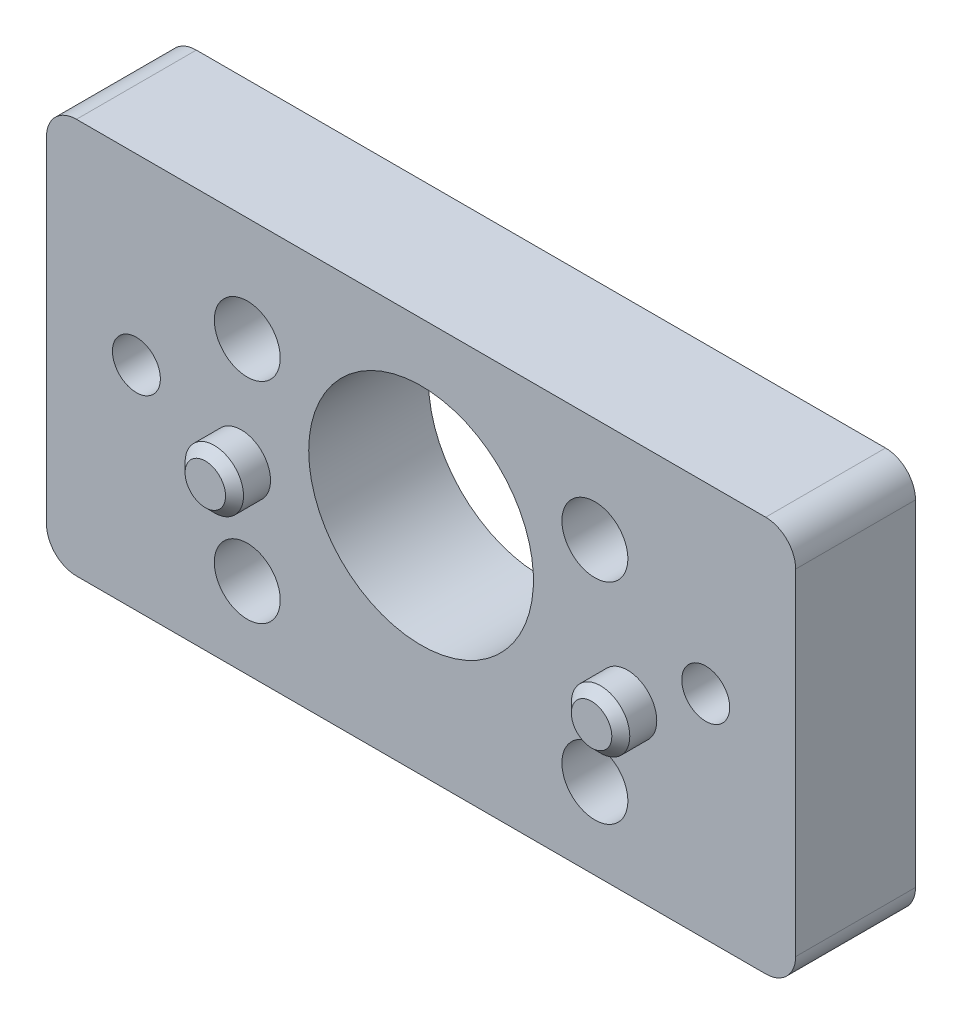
ISO-10303-21;
HEADER;
FILE_DESCRIPTION(('STEP AP214'),'2;1');
FILE_NAME('part.step','',(''),(''),'','','');
FILE_SCHEMA(('AUTOMOTIVE_DESIGN { 1 0 10303 214 1 1 1 1 }'));
ENDSEC;
DATA;
#1=APPLICATION_CONTEXT('core data for automotive mechanical design processes');
#2=APPLICATION_PROTOCOL_DEFINITION('international standard','automotive_design',2000,#1);
#3=PRODUCT_CONTEXT('',#1,'mechanical');
#4=PRODUCT('Part','Part','',(#3));
#5=PRODUCT_RELATED_PRODUCT_CATEGORY('part','',(#4));
#6=PRODUCT_DEFINITION_FORMATION('','',#4);
#7=PRODUCT_DEFINITION_CONTEXT('part definition',#1,'design');
#8=PRODUCT_DEFINITION('design','',#6,#7);
#9=PRODUCT_DEFINITION_SHAPE('','',#8);
#10=(LENGTH_UNIT() NAMED_UNIT(*) SI_UNIT(.MILLI.,.METRE.));
#11=(NAMED_UNIT(*) PLANE_ANGLE_UNIT() SI_UNIT($,.RADIAN.));
#12=(NAMED_UNIT(*) SI_UNIT($,.STERADIAN.) SOLID_ANGLE_UNIT());
#13=UNCERTAINTY_MEASURE_WITH_UNIT(LENGTH_MEASURE(1.E-05),#10,'distance_accuracy_value','');
#14=(GEOMETRIC_REPRESENTATION_CONTEXT(3) GLOBAL_UNCERTAINTY_ASSIGNED_CONTEXT((#13)) GLOBAL_UNIT_ASSIGNED_CONTEXT((#10,
#11,#12)) REPRESENTATION_CONTEXT('',''));
#15=CARTESIAN_POINT('',(0.,0.,0.));
#16=DIRECTION('',(0.,0.,1.));
#17=DIRECTION('',(1.,0.,0.));
#18=AXIS2_PLACEMENT_3D('',#15,#16,#17);
#19=CARTESIAN_POINT('',(0.,0.,4.));
#20=DIRECTION('',(0.,0.,1.));
#21=DIRECTION('',(1.,0.,0.));
#22=AXIS2_PLACEMENT_3D('',#19,#20,#21);
#23=PLANE('',#22);
#24=CARTESIAN_POINT('',(9.5,1.,4.));
#25=DIRECTION('',(0.,0.,1.));
#26=DIRECTION('',(1.,0.,0.));
#27=AXIS2_PLACEMENT_3D('',#24,#25,#26);
#28=CIRCLE('',#27,0.799999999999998);
#29=CARTESIAN_POINT('',(10.3,1.,4.));
#30=VERTEX_POINT('',#29);
#31=EDGE_CURVE('E373',#30,#30,#28,.T.);
#32=ORIENTED_EDGE('',*,*,#31,.F.);
#33=EDGE_LOOP('',(#32));
#34=FACE_BOUND('',#33,.T.);
#35=CARTESIAN_POINT('',(-9.5,1.,4.));
#36=DIRECTION('',(0.,0.,1.));
#37=DIRECTION('',(1.,0.,0.));
#38=AXIS2_PLACEMENT_3D('',#35,#36,#37);
#39=CIRCLE('',#38,0.799999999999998);
#40=CARTESIAN_POINT('',(-8.7,1.,4.));
#41=VERTEX_POINT('',#40);
#42=EDGE_CURVE('E182',#41,#41,#39,.T.);
#43=ORIENTED_EDGE('',*,*,#42,.F.);
#44=EDGE_LOOP('',(#43));
#45=FACE_BOUND('',#44,.T.);
#46=CARTESIAN_POINT('',(6.89030643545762,-0.600000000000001,4.));
#47=DIRECTION('',(0.,0.,1.));
#48=DIRECTION('',(1.,0.,0.));
#49=AXIS2_PLACEMENT_3D('',#46,#47,#48);
#50=CIRCLE('',#49,0.975);
#51=CARTESIAN_POINT('',(7.86530643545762,-0.600000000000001,4.));
#52=VERTEX_POINT('',#51);
#53=EDGE_CURVE('E196',#52,#52,#50,.T.);
#54=ORIENTED_EDGE('',*,*,#53,.F.);
#55=EDGE_LOOP('',(#54));
#56=FACE_BOUND('',#55,.T.);
#57=CARTESIAN_POINT('',(-6.,-0.0999999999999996,4.));
#58=DIRECTION('',(0.,0.,1.));
#59=DIRECTION('',(1.,0.,0.));
#60=AXIS2_PLACEMENT_3D('',#57,#58,#59);
#61=CIRCLE('',#60,0.975);
#62=CARTESIAN_POINT('',(-5.025,-0.0999999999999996,4.));
#63=VERTEX_POINT('',#62);
#64=EDGE_CURVE('E199',#63,#63,#61,.T.);
#65=ORIENTED_EDGE('',*,*,#64,.F.);
#66=EDGE_LOOP('',(#65));
#67=FACE_BOUND('',#66,.T.);
#68=CARTESIAN_POINT('',(0.,1.4,4.));
#69=DIRECTION('',(0.,0.,-1.));
#70=DIRECTION('',(-1.,0.,0.));
#71=AXIS2_PLACEMENT_3D('',#68,#69,#70);
#72=CIRCLE('',#71,3.75);
#73=CARTESIAN_POINT('',(-3.75,1.4,4.));
#74=VERTEX_POINT('',#73);
#75=EDGE_CURVE('E203',#74,#74,#72,.T.);
#76=ORIENTED_EDGE('',*,*,#75,.T.);
#77=EDGE_LOOP('',(#76));
#78=FACE_BOUND('',#77,.T.);
#79=CARTESIAN_POINT('',(5.8,-3.4,4.));
#80=DIRECTION('',(0.,0.,-1.));
#81=DIRECTION('',(-1.,0.,0.));
#82=AXIS2_PLACEMENT_3D('',#79,#80,#81);
#83=CIRCLE('',#82,1.10000000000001);
#84=CARTESIAN_POINT('',(4.69999999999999,-3.4,4.));
#85=VERTEX_POINT('',#84);
#86=EDGE_CURVE('E241',#85,#85,#83,.T.);
#87=ORIENTED_EDGE('',*,*,#86,.T.);
#88=EDGE_LOOP('',(#87));
#89=FACE_BOUND('',#88,.T.);
#90=CARTESIAN_POINT('',(-5.8,-3.39999999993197,4.));
#91=DIRECTION('',(0.,0.,-1.));
#92=DIRECTION('',(-1.,0.,0.));
#93=AXIS2_PLACEMENT_3D('',#90,#91,#92);
#94=CIRCLE('',#93,1.10000000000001);
#95=CARTESIAN_POINT('',(-6.90000000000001,-3.39999999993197,4.));
#96=VERTEX_POINT('',#95);
#97=EDGE_CURVE('E253',#96,#96,#94,.T.);
#98=ORIENTED_EDGE('',*,*,#97,.T.);
#99=EDGE_LOOP('',(#98));
#100=FACE_BOUND('',#99,.T.);
#101=DIRECTION('',(1.,0.,0.));
#102=VECTOR('',#101,1.);
#103=CARTESIAN_POINT('',(-12.5,7.1,4.));
#104=LINE('',#103,#102);
#105=CARTESIAN_POINT('',(-11.5,7.1,4.));
#106=VERTEX_POINT('',#105);
#107=CARTESIAN_POINT('',(11.5,7.1,4.));
#108=VERTEX_POINT('',#107);
#109=EDGE_CURVE('E369',#106,#108,#104,.T.);
#110=ORIENTED_EDGE('',*,*,#109,.F.);
#111=CARTESIAN_POINT('',(-11.5,6.1,4.));
#112=DIRECTION('',(0.,0.,1.));
#113=DIRECTION('',(1.,0.,0.));
#114=AXIS2_PLACEMENT_3D('',#111,#112,#113);
#115=CIRCLE('',#114,1.);
#116=CARTESIAN_POINT('',(-12.5,6.1,4.));
#117=VERTEX_POINT('',#116);
#118=EDGE_CURVE('E325',#106,#117,#115,.T.);
#119=ORIENTED_EDGE('',*,*,#118,.T.);
#120=DIRECTION('',(0.,-1.,0.));
#121=VECTOR('',#120,1.);
#122=CARTESIAN_POINT('',(-12.5,6.1,4.));
#123=LINE('',#122,#121);
#124=CARTESIAN_POINT('',(-12.5,-5.1,4.));
#125=VERTEX_POINT('',#124);
#126=EDGE_CURVE('E260',#117,#125,#123,.T.);
#127=ORIENTED_EDGE('',*,*,#126,.T.);
#128=CARTESIAN_POINT('',(-11.5,-5.1,4.));
#129=DIRECTION('',(0.,0.,1.));
#130=DIRECTION('',(1.,0.,0.));
#131=AXIS2_PLACEMENT_3D('',#128,#129,#130);
#132=CIRCLE('',#131,1.);
#133=CARTESIAN_POINT('',(-11.5,-6.1,4.));
#134=VERTEX_POINT('',#133);
#135=EDGE_CURVE('E321',#125,#134,#132,.T.);
#136=ORIENTED_EDGE('',*,*,#135,.T.);
#137=DIRECTION('',(1.,0.,0.));
#138=VECTOR('',#137,1.);
#139=CARTESIAN_POINT('',(-12.5,-6.1,4.));
#140=LINE('',#139,#138);
#141=CARTESIAN_POINT('',(11.5,-6.1,4.));
#142=VERTEX_POINT('',#141);
#143=EDGE_CURVE('E264',#134,#142,#140,.T.);
#144=ORIENTED_EDGE('',*,*,#143,.T.);
#145=CARTESIAN_POINT('',(11.5,-5.1,4.));
#146=DIRECTION('',(0.,0.,1.));
#147=DIRECTION('',(1.,0.,0.));
#148=AXIS2_PLACEMENT_3D('',#145,#146,#147);
#149=CIRCLE('',#148,1.);
#150=CARTESIAN_POINT('',(12.5,-5.1,4.));
#151=VERTEX_POINT('',#150);
#152=EDGE_CURVE('E319',#142,#151,#149,.T.);
#153=ORIENTED_EDGE('',*,*,#152,.T.);
#154=DIRECTION('',(0.,1.,0.));
#155=VECTOR('',#154,1.);
#156=CARTESIAN_POINT('',(12.5,6.1,4.));
#157=LINE('',#156,#155);
#158=CARTESIAN_POINT('',(12.5,6.1,4.));
#159=VERTEX_POINT('',#158);
#160=EDGE_CURVE('E257',#151,#159,#157,.T.);
#161=ORIENTED_EDGE('',*,*,#160,.T.);
#162=CARTESIAN_POINT('',(11.5,6.1,4.));
#163=DIRECTION('',(0.,0.,1.));
#164=DIRECTION('',(1.,0.,0.));
#165=AXIS2_PLACEMENT_3D('',#162,#163,#164);
#166=CIRCLE('',#165,1.);
#167=EDGE_CURVE('E323',#159,#108,#166,.T.);
#168=ORIENTED_EDGE('',*,*,#167,.T.);
#169=EDGE_LOOP('',(#110,#119,#127,#136,#144,#153,#161,#168));
#170=FACE_BOUND('',#169,.T.);
#171=CARTESIAN_POINT('',(-5.8,3.59999999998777,4.));
#172=DIRECTION('',(0.,0.,-1.));
#173=DIRECTION('',(-1.,0.,0.));
#174=AXIS2_PLACEMENT_3D('',#171,#172,#173);
#175=CIRCLE('',#174,1.10000000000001);
#176=CARTESIAN_POINT('',(-6.90000000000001,3.59999999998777,4.));
#177=VERTEX_POINT('',#176);
#178=EDGE_CURVE('E229',#177,#177,#175,.T.);
#179=ORIENTED_EDGE('',*,*,#178,.T.);
#180=EDGE_LOOP('',(#179));
#181=FACE_BOUND('',#180,.T.);
#182=CARTESIAN_POINT('',(5.8,3.59999999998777,4.));
#183=DIRECTION('',(0.,0.,-1.));
#184=DIRECTION('',(-1.,0.,0.));
#185=AXIS2_PLACEMENT_3D('',#182,#183,#184);
#186=CIRCLE('',#185,1.10000000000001);
#187=CARTESIAN_POINT('',(4.69999999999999,3.59999999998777,4.));
#188=VERTEX_POINT('',#187);
#189=EDGE_CURVE('E217',#188,#188,#186,.T.);
#190=ORIENTED_EDGE('',*,*,#189,.T.);
#191=EDGE_LOOP('',(#190));
#192=FACE_BOUND('',#191,.T.);
#193=ADVANCED_FACE('F49',(#34,#45,#56,#67,#78,#89,#100,#170,#181,#192),#23,.T.);
#194=CARTESIAN_POINT('',(12.5,6.1,4.));
#195=DIRECTION('',(-1.,0.,0.));
#196=DIRECTION('',(0.,0.,1.));
#197=AXIS2_PLACEMENT_3D('',#194,#195,#196);
#198=PLANE('',#197);
#199=DIRECTION('',(0.,1.,0.));
#200=VECTOR('',#199,1.);
#201=CARTESIAN_POINT('',(12.5,6.1,0.));
#202=LINE('',#201,#200);
#203=CARTESIAN_POINT('',(12.5,-5.1,0.));
#204=VERTEX_POINT('',#203);
#205=CARTESIAN_POINT('',(12.5,6.1,0.));
#206=VERTEX_POINT('',#205);
#207=EDGE_CURVE('E256',#204,#206,#202,.T.);
#208=ORIENTED_EDGE('',*,*,#207,.T.);
#209=DIRECTION('',(0.,0.,-1.));
#210=VECTOR('',#209,1.);
#211=CARTESIAN_POINT('',(12.5,6.1,4.));
#212=LINE('',#211,#210);
#213=EDGE_CURVE('E340',#206,#159,#212,.F.);
#214=ORIENTED_EDGE('',*,*,#213,.T.);
#215=ORIENTED_EDGE('',*,*,#160,.F.);
#216=DIRECTION('',(0.,0.,-1.));
#217=VECTOR('',#216,1.);
#218=CARTESIAN_POINT('',(12.5,-5.1,4.));
#219=LINE('',#218,#217);
#220=EDGE_CURVE('E337',#151,#204,#219,.T.);
#221=ORIENTED_EDGE('',*,*,#220,.T.);
#222=EDGE_LOOP('',(#208,#214,#215,#221));
#223=FACE_BOUND('',#222,.T.);
#224=ADVANCED_FACE('F354',(#223),#198,.F.);
#225=CARTESIAN_POINT('',(-12.5,6.1,4.));
#226=DIRECTION('',(1.,0.,0.));
#227=DIRECTION('',(0.,0.,-1.));
#228=AXIS2_PLACEMENT_3D('',#225,#226,#227);
#229=PLANE('',#228);
#230=ORIENTED_EDGE('',*,*,#126,.F.);
#231=DIRECTION('',(0.,0.,1.));
#232=VECTOR('',#231,1.);
#233=CARTESIAN_POINT('',(-12.5,6.1,0.));
#234=LINE('',#233,#232);
#235=CARTESIAN_POINT('',(-12.5,6.1,0.));
#236=VERTEX_POINT('',#235);
#237=EDGE_CURVE('E329',#117,#236,#234,.F.);
#238=ORIENTED_EDGE('',*,*,#237,.T.);
#239=DIRECTION('',(0.,-1.,0.));
#240=VECTOR('',#239,1.);
#241=CARTESIAN_POINT('',(-12.5,6.1,0.));
#242=LINE('',#241,#240);
#243=CARTESIAN_POINT('',(-12.5,-5.1,0.));
#244=VERTEX_POINT('',#243);
#245=EDGE_CURVE('E270',#236,#244,#242,.T.);
#246=ORIENTED_EDGE('',*,*,#245,.T.);
#247=DIRECTION('',(0.,0.,-1.));
#248=VECTOR('',#247,1.);
#249=CARTESIAN_POINT('',(-12.5,-5.1,4.));
#250=LINE('',#249,#248);
#251=EDGE_CURVE('E327',#244,#125,#250,.F.);
#252=ORIENTED_EDGE('',*,*,#251,.T.);
#253=EDGE_LOOP('',(#230,#238,#246,#252));
#254=FACE_BOUND('',#253,.T.);
#255=ADVANCED_FACE('F426',(#254),#229,.F.);
#256=CARTESIAN_POINT('',(-12.5,-6.1,4.));
#257=DIRECTION('',(0.,1.,0.));
#258=DIRECTION('',(0.,0.,1.));
#259=AXIS2_PLACEMENT_3D('',#256,#257,#258);
#260=PLANE('',#259);
#261=ORIENTED_EDGE('',*,*,#143,.F.);
#262=DIRECTION('',(0.,0.,-1.));
#263=VECTOR('',#262,1.);
#264=CARTESIAN_POINT('',(-11.5,-6.1,4.));
#265=LINE('',#264,#263);
#266=CARTESIAN_POINT('',(-11.5,-6.1,0.));
#267=VERTEX_POINT('',#266);
#268=EDGE_CURVE('E13',#134,#267,#265,.T.);
#269=ORIENTED_EDGE('',*,*,#268,.T.);
#270=DIRECTION('',(1.,0.,0.));
#271=VECTOR('',#270,1.);
#272=CARTESIAN_POINT('',(-12.5,-6.1,0.));
#273=LINE('',#272,#271);
#274=CARTESIAN_POINT('',(11.5,-6.1,0.));
#275=VERTEX_POINT('',#274);
#276=EDGE_CURVE('E261',#267,#275,#273,.T.);
#277=ORIENTED_EDGE('',*,*,#276,.T.);
#278=DIRECTION('',(0.,0.,-1.));
#279=VECTOR('',#278,1.);
#280=CARTESIAN_POINT('',(11.5,-6.1,4.));
#281=LINE('',#280,#279);
#282=EDGE_CURVE('E57',#275,#142,#281,.F.);
#283=ORIENTED_EDGE('',*,*,#282,.T.);
#284=EDGE_LOOP('',(#261,#269,#277,#283));
#285=FACE_BOUND('',#284,.T.);
#286=ADVANCED_FACE('F344',(#285),#260,.F.);
#287=CARTESIAN_POINT('',(0.,0.,0.));
#288=DIRECTION('',(0.,0.,1.));
#289=DIRECTION('',(1.,0.,0.));
#290=AXIS2_PLACEMENT_3D('',#287,#288,#289);
#291=PLANE('',#290);
#292=CARTESIAN_POINT('',(9.5,1.,0.));
#293=DIRECTION('',(0.,0.,-1.));
#294=DIRECTION('',(-1.,0.,0.));
#295=AXIS2_PLACEMENT_3D('',#292,#293,#294);
#296=CIRCLE('',#295,0.799999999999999);
#297=CARTESIAN_POINT('',(8.7,1.,0.));
#298=VERTEX_POINT('',#297);
#299=EDGE_CURVE('E370',#298,#298,#296,.T.);
#300=ORIENTED_EDGE('',*,*,#299,.F.);
#301=EDGE_LOOP('',(#300));
#302=FACE_BOUND('',#301,.T.);
#303=CARTESIAN_POINT('',(-9.5,1.,0.));
#304=DIRECTION('',(0.,0.,-1.));
#305=DIRECTION('',(-1.,0.,0.));
#306=AXIS2_PLACEMENT_3D('',#303,#304,#305);
#307=CIRCLE('',#306,0.799999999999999);
#308=CARTESIAN_POINT('',(-10.3,1.,0.));
#309=VERTEX_POINT('',#308);
#310=EDGE_CURVE('E378',#309,#309,#307,.T.);
#311=ORIENTED_EDGE('',*,*,#310,.F.);
#312=EDGE_LOOP('',(#311));
#313=FACE_BOUND('',#312,.T.);
#314=CARTESIAN_POINT('',(10.,-3.6,0.));
#315=DIRECTION('',(0.,0.,1.));
#316=DIRECTION('',(1.,0.,0.));
#317=AXIS2_PLACEMENT_3D('',#314,#315,#316);
#318=CIRCLE('',#317,1.325);
#319=CARTESIAN_POINT('',(11.325,-3.6,0.));
#320=VERTEX_POINT('',#319);
#321=EDGE_CURVE('E297',#320,#320,#318,.T.);
#322=ORIENTED_EDGE('',*,*,#321,.T.);
#323=EDGE_LOOP('',(#322));
#324=FACE_BOUND('',#323,.T.);
#325=DIRECTION('',(1.,0.,0.));
#326=VECTOR('',#325,1.);
#327=CARTESIAN_POINT('',(0.,-4.925,0.));
#328=LINE('',#327,#326);
#329=CARTESIAN_POINT('',(-10.5,-4.925,0.));
#330=VERTEX_POINT('',#329);
#331=CARTESIAN_POINT('',(-9.5,-4.925,0.));
#332=VERTEX_POINT('',#331);
#333=EDGE_CURVE('E292',#330,#332,#328,.T.);
#334=ORIENTED_EDGE('',*,*,#333,.T.);
#335=CARTESIAN_POINT('',(-9.5,-3.6,0.));
#336=DIRECTION('',(0.,0.,1.));
#337=DIRECTION('',(1.,0.,0.));
#338=AXIS2_PLACEMENT_3D('',#335,#336,#337);
#339=CIRCLE('',#338,1.325);
#340=CARTESIAN_POINT('',(-9.5,-2.275,0.));
#341=VERTEX_POINT('',#340);
#342=EDGE_CURVE('E294',#332,#341,#339,.T.);
#343=ORIENTED_EDGE('',*,*,#342,.T.);
#344=DIRECTION('',(-1.,0.,0.));
#345=VECTOR('',#344,1.);
#346=CARTESIAN_POINT('',(0.,-2.275,0.));
#347=LINE('',#346,#345);
#348=CARTESIAN_POINT('',(-10.5,-2.275,0.));
#349=VERTEX_POINT('',#348);
#350=EDGE_CURVE('E290',#341,#349,#347,.T.);
#351=ORIENTED_EDGE('',*,*,#350,.T.);
#352=CARTESIAN_POINT('',(-10.5,-3.6,0.));
#353=DIRECTION('',(0.,0.,1.));
#354=DIRECTION('',(1.,0.,0.));
#355=AXIS2_PLACEMENT_3D('',#352,#353,#354);
#356=CIRCLE('',#355,1.325);
#357=EDGE_CURVE('E288',#349,#330,#356,.T.);
#358=ORIENTED_EDGE('',*,*,#357,.T.);
#359=EDGE_LOOP('',(#334,#343,#351,#358));
#360=FACE_BOUND('',#359,.T.);
#361=CARTESIAN_POINT('',(0.,1.4,0.));
#362=DIRECTION('',(0.,0.,-1.));
#363=DIRECTION('',(-1.,0.,0.));
#364=AXIS2_PLACEMENT_3D('',#361,#362,#363);
#365=CIRCLE('',#364,3.75);
#366=CARTESIAN_POINT('',(-3.75,1.4,0.));
#367=VERTEX_POINT('',#366);
#368=EDGE_CURVE('E202',#367,#367,#365,.T.);
#369=ORIENTED_EDGE('',*,*,#368,.F.);
#370=EDGE_LOOP('',(#369));
#371=FACE_BOUND('',#370,.T.);
#372=CARTESIAN_POINT('',(5.8,3.59999999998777,0.));
#373=DIRECTION('',(0.,0.,-1.));
#374=DIRECTION('',(-1.,0.,0.));
#375=AXIS2_PLACEMENT_3D('',#372,#373,#374);
#376=CIRCLE('',#375,2.1);
#377=CARTESIAN_POINT('',(3.7,3.59999999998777,0.));
#378=VERTEX_POINT('',#377);
#379=EDGE_CURVE('E206',#378,#378,#376,.T.);
#380=ORIENTED_EDGE('',*,*,#379,.F.);
#381=EDGE_LOOP('',(#380));
#382=FACE_BOUND('',#381,.T.);
#383=CARTESIAN_POINT('',(-5.8,3.59999999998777,0.));
#384=DIRECTION('',(0.,0.,-1.));
#385=DIRECTION('',(-1.,0.,0.));
#386=AXIS2_PLACEMENT_3D('',#383,#384,#385);
#387=CIRCLE('',#386,2.1);
#388=CARTESIAN_POINT('',(-7.9,3.59999999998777,0.));
#389=VERTEX_POINT('',#388);
#390=EDGE_CURVE('E220',#389,#389,#387,.T.);
#391=ORIENTED_EDGE('',*,*,#390,.F.);
#392=EDGE_LOOP('',(#391));
#393=FACE_BOUND('',#392,.T.);
#394=CARTESIAN_POINT('',(5.8,-3.4,0.));
#395=DIRECTION('',(0.,0.,-1.));
#396=DIRECTION('',(-1.,0.,0.));
#397=AXIS2_PLACEMENT_3D('',#394,#395,#396);
#398=CIRCLE('',#397,2.1);
#399=CARTESIAN_POINT('',(3.7,-3.4,0.));
#400=VERTEX_POINT('',#399);
#401=EDGE_CURVE('E232',#400,#400,#398,.T.);
#402=ORIENTED_EDGE('',*,*,#401,.F.);
#403=EDGE_LOOP('',(#402));
#404=FACE_BOUND('',#403,.T.);
#405=CARTESIAN_POINT('',(-5.8,-3.39999999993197,0.));
#406=DIRECTION('',(0.,0.,-1.));
#407=DIRECTION('',(-1.,0.,0.));
#408=AXIS2_PLACEMENT_3D('',#405,#406,#407);
#409=CIRCLE('',#408,2.1);
#410=CARTESIAN_POINT('',(-7.9,-3.39999999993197,0.));
#411=VERTEX_POINT('',#410);
#412=EDGE_CURVE('E244',#411,#411,#409,.T.);
#413=ORIENTED_EDGE('',*,*,#412,.F.);
#414=EDGE_LOOP('',(#413));
#415=FACE_BOUND('',#414,.T.);
#416=ORIENTED_EDGE('',*,*,#245,.F.);
#417=CARTESIAN_POINT('',(-11.5,6.1,0.));
#418=DIRECTION('',(0.,0.,1.));
#419=DIRECTION('',(1.,0.,0.));
#420=AXIS2_PLACEMENT_3D('',#417,#418,#419);
#421=CIRCLE('',#420,1.);
#422=CARTESIAN_POINT('',(-11.5,7.1,0.));
#423=VERTEX_POINT('',#422);
#424=EDGE_CURVE('E335',#236,#423,#421,.F.);
#425=ORIENTED_EDGE('',*,*,#424,.T.);
#426=DIRECTION('',(-1.,0.,0.));
#427=VECTOR('',#426,1.);
#428=CARTESIAN_POINT('',(12.5,7.1,0.));
#429=LINE('',#428,#427);
#430=CARTESIAN_POINT('',(11.5,7.1,0.));
#431=VERTEX_POINT('',#430);
#432=EDGE_CURVE('E360',#431,#423,#429,.T.);
#433=ORIENTED_EDGE('',*,*,#432,.F.);
#434=CARTESIAN_POINT('',(11.5,6.1,0.));
#435=DIRECTION('',(0.,0.,1.));
#436=DIRECTION('',(1.,0.,0.));
#437=AXIS2_PLACEMENT_3D('',#434,#435,#436);
#438=CIRCLE('',#437,1.);
#439=EDGE_CURVE('E333',#431,#206,#438,.F.);
#440=ORIENTED_EDGE('',*,*,#439,.T.);
#441=ORIENTED_EDGE('',*,*,#207,.F.);
#442=CARTESIAN_POINT('',(11.5,-5.1,0.));
#443=DIRECTION('',(0.,0.,1.));
#444=DIRECTION('',(1.,0.,0.));
#445=AXIS2_PLACEMENT_3D('',#442,#443,#444);
#446=CIRCLE('',#445,1.);
#447=EDGE_CURVE('E64',#204,#275,#446,.F.);
#448=ORIENTED_EDGE('',*,*,#447,.T.);
#449=ORIENTED_EDGE('',*,*,#276,.F.);
#450=CARTESIAN_POINT('',(-11.5,-5.1,0.));
#451=DIRECTION('',(0.,0.,1.));
#452=DIRECTION('',(1.,0.,0.));
#453=AXIS2_PLACEMENT_3D('',#450,#451,#452);
#454=CIRCLE('',#453,1.);
#455=EDGE_CURVE('E72',#267,#244,#454,.F.);
#456=ORIENTED_EDGE('',*,*,#455,.T.);
#457=EDGE_LOOP('',(#416,#425,#433,#440,#441,#448,#449,#456));
#458=FACE_BOUND('',#457,.T.);
#459=ADVANCED_FACE('F357',(#302,#313,#324,#360,#371,#382,#393,#404,#415,#458),#291,.F.);
#460=CARTESIAN_POINT('',(-5.8,-3.39999999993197,0.));
#461=DIRECTION('',(0.,0.,-1.));
#462=DIRECTION('',(-1.,0.,0.));
#463=AXIS2_PLACEMENT_3D('',#460,#461,#462);
#464=CYLINDRICAL_SURFACE('',#463,1.10000000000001);
#465=ORIENTED_EDGE('',*,*,#97,.F.);
#466=EDGE_LOOP('',(#465));
#467=FACE_BOUND('',#466,.T.);
#468=CARTESIAN_POINT('',(-5.8,-3.39999999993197,2.2));
#469=DIRECTION('',(0.,0.,-1.));
#470=DIRECTION('',(-1.,0.,0.));
#471=AXIS2_PLACEMENT_3D('',#468,#469,#470);
#472=CIRCLE('',#471,1.10000000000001);
#473=CARTESIAN_POINT('',(-6.90000000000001,-3.39999999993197,2.2));
#474=VERTEX_POINT('',#473);
#475=EDGE_CURVE('E250',#474,#474,#472,.T.);
#476=ORIENTED_EDGE('',*,*,#475,.T.);
#477=EDGE_LOOP('',(#476));
#478=FACE_BOUND('',#477,.T.);
#479=ADVANCED_FACE('F401',(#467,#478),#464,.F.);
#480=CARTESIAN_POINT('',(-4.69999999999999,-3.39999999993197,2.2));
#481=DIRECTION('',(0.,0.,1.));
#482=DIRECTION('',(1.,0.,0.));
#483=AXIS2_PLACEMENT_3D('',#480,#481,#482);
#484=PLANE('',#483);
#485=ORIENTED_EDGE('',*,*,#475,.F.);
#486=EDGE_LOOP('',(#485));
#487=FACE_BOUND('',#486,.T.);
#488=CARTESIAN_POINT('',(-5.8,-3.39999999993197,2.2));
#489=DIRECTION('',(0.,0.,-1.));
#490=DIRECTION('',(-1.,0.,0.));
#491=AXIS2_PLACEMENT_3D('',#488,#489,#490);
#492=CIRCLE('',#491,2.1);
#493=CARTESIAN_POINT('',(-7.9,-3.39999999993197,2.2));
#494=VERTEX_POINT('',#493);
#495=EDGE_CURVE('E247',#494,#494,#492,.T.);
#496=ORIENTED_EDGE('',*,*,#495,.T.);
#497=EDGE_LOOP('',(#496));
#498=FACE_BOUND('',#497,.T.);
#499=ADVANCED_FACE('F404',(#487,#498),#484,.F.);
#500=CARTESIAN_POINT('',(-5.8,-3.39999999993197,0.));
#501=DIRECTION('',(0.,0.,-1.));
#502=DIRECTION('',(-1.,0.,0.));
#503=AXIS2_PLACEMENT_3D('',#500,#501,#502);
#504=CYLINDRICAL_SURFACE('',#503,2.1);
#505=ORIENTED_EDGE('',*,*,#495,.F.);
#506=EDGE_LOOP('',(#505));
#507=FACE_BOUND('',#506,.T.);
#508=ORIENTED_EDGE('',*,*,#412,.T.);
#509=EDGE_LOOP('',(#508));
#510=FACE_BOUND('',#509,.T.);
#511=ADVANCED_FACE('F410',(#507,#510),#504,.F.);
#512=CARTESIAN_POINT('',(5.8,-3.4,0.));
#513=DIRECTION('',(0.,0.,-1.));
#514=DIRECTION('',(-1.,0.,0.));
#515=AXIS2_PLACEMENT_3D('',#512,#513,#514);
#516=CYLINDRICAL_SURFACE('',#515,1.10000000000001);
#517=ORIENTED_EDGE('',*,*,#86,.F.);
#518=EDGE_LOOP('',(#517));
#519=FACE_BOUND('',#518,.T.);
#520=CARTESIAN_POINT('',(5.8,-3.4,2.2));
#521=DIRECTION('',(0.,0.,-1.));
#522=DIRECTION('',(-1.,0.,0.));
#523=AXIS2_PLACEMENT_3D('',#520,#521,#522);
#524=CIRCLE('',#523,1.10000000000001);
#525=CARTESIAN_POINT('',(4.69999999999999,-3.4,2.2));
#526=VERTEX_POINT('',#525);
#527=EDGE_CURVE('E238',#526,#526,#524,.T.);
#528=ORIENTED_EDGE('',*,*,#527,.T.);
#529=EDGE_LOOP('',(#528));
#530=FACE_BOUND('',#529,.T.);
#531=ADVANCED_FACE('F416',(#519,#530),#516,.F.);
#532=CARTESIAN_POINT('',(6.90000000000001,-3.4,2.2));
#533=DIRECTION('',(0.,0.,1.));
#534=DIRECTION('',(1.,0.,0.));
#535=AXIS2_PLACEMENT_3D('',#532,#533,#534);
#536=PLANE('',#535);
#537=ORIENTED_EDGE('',*,*,#527,.F.);
#538=EDGE_LOOP('',(#537));
#539=FACE_BOUND('',#538,.T.);
#540=CARTESIAN_POINT('',(5.8,-3.4,2.2));
#541=DIRECTION('',(0.,0.,-1.));
#542=DIRECTION('',(-1.,0.,0.));
#543=AXIS2_PLACEMENT_3D('',#540,#541,#542);
#544=CIRCLE('',#543,2.1);
#545=CARTESIAN_POINT('',(3.7,-3.4,2.2));
#546=VERTEX_POINT('',#545);
#547=EDGE_CURVE('E235',#546,#546,#544,.T.);
#548=ORIENTED_EDGE('',*,*,#547,.T.);
#549=EDGE_LOOP('',(#548));
#550=FACE_BOUND('',#549,.T.);
#551=ADVANCED_FACE('F781',(#539,#550),#536,.F.);
#552=CARTESIAN_POINT('',(5.8,-3.4,0.));
#553=DIRECTION('',(0.,0.,-1.));
#554=DIRECTION('',(-1.,0.,0.));
#555=AXIS2_PLACEMENT_3D('',#552,#553,#554);
#556=CYLINDRICAL_SURFACE('',#555,2.1);
#557=ORIENTED_EDGE('',*,*,#547,.F.);
#558=EDGE_LOOP('',(#557));
#559=FACE_BOUND('',#558,.T.);
#560=ORIENTED_EDGE('',*,*,#401,.T.);
#561=EDGE_LOOP('',(#560));
#562=FACE_BOUND('',#561,.T.);
#563=ADVANCED_FACE('F771',(#559,#562),#556,.F.);
#564=CARTESIAN_POINT('',(-5.8,3.59999999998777,0.));
#565=DIRECTION('',(0.,0.,-1.));
#566=DIRECTION('',(-1.,0.,0.));
#567=AXIS2_PLACEMENT_3D('',#564,#565,#566);
#568=CYLINDRICAL_SURFACE('',#567,1.10000000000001);
#569=ORIENTED_EDGE('',*,*,#178,.F.);
#570=EDGE_LOOP('',(#569));
#571=FACE_BOUND('',#570,.T.);
#572=CARTESIAN_POINT('',(-5.8,3.59999999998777,2.2));
#573=DIRECTION('',(0.,0.,-1.));
#574=DIRECTION('',(-1.,0.,0.));
#575=AXIS2_PLACEMENT_3D('',#572,#573,#574);
#576=CIRCLE('',#575,1.10000000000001);
#577=CARTESIAN_POINT('',(-6.90000000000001,3.59999999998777,2.2));
#578=VERTEX_POINT('',#577);
#579=EDGE_CURVE('E226',#578,#578,#576,.T.);
#580=ORIENTED_EDGE('',*,*,#579,.T.);
#581=EDGE_LOOP('',(#580));
#582=FACE_BOUND('',#581,.T.);
#583=ADVANCED_FACE('F761',(#571,#582),#568,.F.);
#584=CARTESIAN_POINT('',(-4.69999999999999,3.59999999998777,2.2));
#585=DIRECTION('',(0.,0.,1.));
#586=DIRECTION('',(1.,0.,0.));
#587=AXIS2_PLACEMENT_3D('',#584,#585,#586);
#588=PLANE('',#587);
#589=ORIENTED_EDGE('',*,*,#579,.F.);
#590=EDGE_LOOP('',(#589));
#591=FACE_BOUND('',#590,.T.);
#592=CARTESIAN_POINT('',(-5.8,3.59999999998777,2.2));
#593=DIRECTION('',(0.,0.,-1.));
#594=DIRECTION('',(-1.,0.,0.));
#595=AXIS2_PLACEMENT_3D('',#592,#593,#594);
#596=CIRCLE('',#595,2.1);
#597=CARTESIAN_POINT('',(-7.9,3.59999999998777,2.2));
#598=VERTEX_POINT('',#597);
#599=EDGE_CURVE('E223',#598,#598,#596,.T.);
#600=ORIENTED_EDGE('',*,*,#599,.T.);
#601=EDGE_LOOP('',(#600));
#602=FACE_BOUND('',#601,.T.);
#603=ADVANCED_FACE('F751',(#591,#602),#588,.F.);
#604=CARTESIAN_POINT('',(-5.8,3.59999999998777,0.));
#605=DIRECTION('',(0.,0.,-1.));
#606=DIRECTION('',(-1.,0.,0.));
#607=AXIS2_PLACEMENT_3D('',#604,#605,#606);
#608=CYLINDRICAL_SURFACE('',#607,2.1);
#609=ORIENTED_EDGE('',*,*,#599,.F.);
#610=EDGE_LOOP('',(#609));
#611=FACE_BOUND('',#610,.T.);
#612=ORIENTED_EDGE('',*,*,#390,.T.);
#613=EDGE_LOOP('',(#612));
#614=FACE_BOUND('',#613,.T.);
#615=ADVANCED_FACE('F741',(#611,#614),#608,.F.);
#616=CARTESIAN_POINT('',(5.8,3.59999999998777,0.));
#617=DIRECTION('',(0.,0.,-1.));
#618=DIRECTION('',(-1.,0.,0.));
#619=AXIS2_PLACEMENT_3D('',#616,#617,#618);
#620=CYLINDRICAL_SURFACE('',#619,1.10000000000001);
#621=ORIENTED_EDGE('',*,*,#189,.F.);
#622=EDGE_LOOP('',(#621));
#623=FACE_BOUND('',#622,.T.);
#624=CARTESIAN_POINT('',(5.8,3.59999999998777,2.2));
#625=DIRECTION('',(0.,0.,-1.));
#626=DIRECTION('',(-1.,0.,0.));
#627=AXIS2_PLACEMENT_3D('',#624,#625,#626);
#628=CIRCLE('',#627,1.10000000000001);
#629=CARTESIAN_POINT('',(4.69999999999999,3.59999999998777,2.2));
#630=VERTEX_POINT('',#629);
#631=EDGE_CURVE('E214',#630,#630,#628,.T.);
#632=ORIENTED_EDGE('',*,*,#631,.T.);
#633=EDGE_LOOP('',(#632));
#634=FACE_BOUND('',#633,.T.);
#635=ADVANCED_FACE('F731',(#623,#634),#620,.F.);
#636=CARTESIAN_POINT('',(6.90000000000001,3.59999999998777,2.2));
#637=DIRECTION('',(0.,0.,1.));
#638=DIRECTION('',(1.,0.,0.));
#639=AXIS2_PLACEMENT_3D('',#636,#637,#638);
#640=PLANE('',#639);
#641=ORIENTED_EDGE('',*,*,#631,.F.);
#642=EDGE_LOOP('',(#641));
#643=FACE_BOUND('',#642,.T.);
#644=CARTESIAN_POINT('',(5.8,3.59999999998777,2.2));
#645=DIRECTION('',(0.,0.,-1.));
#646=DIRECTION('',(-1.,0.,0.));
#647=AXIS2_PLACEMENT_3D('',#644,#645,#646);
#648=CIRCLE('',#647,2.1);
#649=CARTESIAN_POINT('',(3.7,3.59999999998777,2.2));
#650=VERTEX_POINT('',#649);
#651=EDGE_CURVE('E211',#650,#650,#648,.T.);
#652=ORIENTED_EDGE('',*,*,#651,.T.);
#653=EDGE_LOOP('',(#652));
#654=FACE_BOUND('',#653,.T.);
#655=ADVANCED_FACE('F721',(#643,#654),#640,.F.);
#656=CARTESIAN_POINT('',(5.8,3.59999999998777,0.));
#657=DIRECTION('',(0.,0.,-1.));
#658=DIRECTION('',(-1.,0.,0.));
#659=AXIS2_PLACEMENT_3D('',#656,#657,#658);
#660=CYLINDRICAL_SURFACE('',#659,2.1);
#661=ORIENTED_EDGE('',*,*,#651,.F.);
#662=EDGE_LOOP('',(#661));
#663=FACE_BOUND('',#662,.T.);
#664=ORIENTED_EDGE('',*,*,#379,.T.);
#665=EDGE_LOOP('',(#664));
#666=FACE_BOUND('',#665,.T.);
#667=ADVANCED_FACE('F711',(#663,#666),#660,.F.);
#668=CARTESIAN_POINT('',(0.,1.4,4.));
#669=DIRECTION('',(0.,0.,-1.));
#670=DIRECTION('',(-1.,0.,0.));
#671=AXIS2_PLACEMENT_3D('',#668,#669,#670);
#672=CYLINDRICAL_SURFACE('',#671,3.75);
#673=ORIENTED_EDGE('',*,*,#75,.F.);
#674=EDGE_LOOP('',(#673));
#675=FACE_BOUND('',#674,.T.);
#676=ORIENTED_EDGE('',*,*,#368,.T.);
#677=EDGE_LOOP('',(#676));
#678=FACE_BOUND('',#677,.T.);
#679=ADVANCED_FACE('F701',(#675,#678),#672,.F.);
#680=CARTESIAN_POINT('',(-6.,-0.0999999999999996,5.2));
#681=DIRECTION('',(0.,0.,-1.));
#682=DIRECTION('',(-1.,0.,0.));
#683=AXIS2_PLACEMENT_3D('',#680,#681,#682);
#684=CYLINDRICAL_SURFACE('',#683,0.975);
#685=CARTESIAN_POINT('',(-6.,-0.0999999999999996,4.9));
#686=DIRECTION('',(0.,0.,1.));
#687=DIRECTION('',(1.,0.,0.));
#688=AXIS2_PLACEMENT_3D('',#685,#686,#687);
#689=CIRCLE('',#688,0.975);
#690=CARTESIAN_POINT('',(-6.975,-0.0999999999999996,4.9));
#691=VERTEX_POINT('',#690);
#692=EDGE_CURVE('E276',#691,#691,#689,.F.);
#693=ORIENTED_EDGE('',*,*,#692,.T.);
#694=EDGE_LOOP('',(#693));
#695=FACE_BOUND('',#694,.T.);
#696=ORIENTED_EDGE('',*,*,#64,.T.);
#697=EDGE_LOOP('',(#696));
#698=FACE_BOUND('',#697,.T.);
#699=ADVANCED_FACE('F691',(#695,#698),#684,.T.);
#700=CARTESIAN_POINT('',(-6.,-0.0999999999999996,5.2));
#701=DIRECTION('',(0.,0.,1.));
#702=DIRECTION('',(1.,0.,0.));
#703=AXIS2_PLACEMENT_3D('',#700,#701,#702);
#704=PLANE('',#703);
#705=CARTESIAN_POINT('',(-6.,-0.0999999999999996,5.2));
#706=DIRECTION('',(0.,0.,1.));
#707=DIRECTION('',(1.,0.,0.));
#708=AXIS2_PLACEMENT_3D('',#705,#706,#707);
#709=CIRCLE('',#708,0.674999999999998);
#710=CARTESIAN_POINT('',(-6.675,-0.0999999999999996,5.2));
#711=VERTEX_POINT('',#710);
#712=EDGE_CURVE('E267',#711,#711,#709,.T.);
#713=ORIENTED_EDGE('',*,*,#712,.T.);
#714=EDGE_LOOP('',(#713));
#715=FACE_BOUND('',#714,.T.);
#716=ADVANCED_FACE('F681',(#715),#704,.T.);
#717=CARTESIAN_POINT('',(6.89030643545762,-0.600000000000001,5.2));
#718=DIRECTION('',(0.,0.,-1.));
#719=DIRECTION('',(-1.,0.,0.));
#720=AXIS2_PLACEMENT_3D('',#717,#718,#719);
#721=CYLINDRICAL_SURFACE('',#720,0.975);
#722=CARTESIAN_POINT('',(6.89030643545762,-0.600000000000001,4.9));
#723=DIRECTION('',(0.,0.,1.));
#724=DIRECTION('',(1.,0.,0.));
#725=AXIS2_PLACEMENT_3D('',#722,#723,#724);
#726=CIRCLE('',#725,0.975);
#727=CARTESIAN_POINT('',(7.86530643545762,-0.600000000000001,4.9));
#728=VERTEX_POINT('',#727);
#729=EDGE_CURVE('E282',#728,#728,#726,.F.);
#730=ORIENTED_EDGE('',*,*,#729,.T.);
#731=EDGE_LOOP('',(#730));
#732=FACE_BOUND('',#731,.T.);
#733=ORIENTED_EDGE('',*,*,#53,.T.);
#734=EDGE_LOOP('',(#733));
#735=FACE_BOUND('',#734,.T.);
#736=ADVANCED_FACE('F671',(#732,#735),#721,.T.);
#737=CARTESIAN_POINT('',(6.89030643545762,-0.600000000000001,5.2));
#738=DIRECTION('',(0.,0.,1.));
#739=DIRECTION('',(1.,0.,0.));
#740=AXIS2_PLACEMENT_3D('',#737,#738,#739);
#741=PLANE('',#740);
#742=CARTESIAN_POINT('',(6.89030643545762,-0.600000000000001,5.2));
#743=DIRECTION('',(0.,0.,1.));
#744=DIRECTION('',(1.,0.,0.));
#745=AXIS2_PLACEMENT_3D('',#742,#743,#744);
#746=CIRCLE('',#745,0.674999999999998);
#747=CARTESIAN_POINT('',(7.56530643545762,-0.600000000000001,5.2));
#748=VERTEX_POINT('',#747);
#749=EDGE_CURVE('E279',#748,#748,#746,.T.);
#750=ORIENTED_EDGE('',*,*,#749,.T.);
#751=EDGE_LOOP('',(#750));
#752=FACE_BOUND('',#751,.T.);
#753=ADVANCED_FACE('F440',(#752),#741,.T.);
#754=CARTESIAN_POINT('',(-6.,-0.0999999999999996,5.2));
#755=DIRECTION('',(0.,0.,-1.));
#756=DIRECTION('',(-1.,0.,0.));
#757=AXIS2_PLACEMENT_3D('',#754,#755,#756);
#758=CONICAL_SURFACE('',#757,0.674999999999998,0.78539816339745);
#759=CARTESIAN_POINT('',(-6.975,-0.0999999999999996,4.9));
#760=CARTESIAN_POINT('',(-6.971875,-0.0999999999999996,4.903125));
#761=CARTESIAN_POINT('',(-6.96875,-0.0999999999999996,4.90625));
#762=CARTESIAN_POINT('',(-6.9625,-0.0999999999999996,4.9125));
#763=CARTESIAN_POINT('',(-6.959375,-0.0999999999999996,4.915625));
#764=CARTESIAN_POINT('',(-6.953125,-0.0999999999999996,4.921875));
#765=CARTESIAN_POINT('',(-6.95,-0.0999999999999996,4.925));
#766=CARTESIAN_POINT('',(-6.94375,-0.0999999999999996,4.93125));
#767=CARTESIAN_POINT('',(-6.940625,-0.0999999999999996,4.934375));
#768=CARTESIAN_POINT('',(-6.934375,-0.0999999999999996,4.940625));
#769=CARTESIAN_POINT('',(-6.93125,-0.0999999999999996,4.94375));
#770=CARTESIAN_POINT('',(-6.925,-0.0999999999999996,4.95));
#771=CARTESIAN_POINT('',(-6.921875,-0.0999999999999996,4.953125));
#772=CARTESIAN_POINT('',(-6.915625,-0.0999999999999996,4.959375));
#773=CARTESIAN_POINT('',(-6.9125,-0.0999999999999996,4.9625));
#774=CARTESIAN_POINT('',(-6.90625,-0.0999999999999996,4.96875));
#775=CARTESIAN_POINT('',(-6.903125,-0.0999999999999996,4.971875));
#776=CARTESIAN_POINT('',(-6.896875,-0.0999999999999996,4.978125));
#777=CARTESIAN_POINT('',(-6.89375,-0.0999999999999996,4.98125));
#778=CARTESIAN_POINT('',(-6.8875,-0.0999999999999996,4.9875));
#779=CARTESIAN_POINT('',(-6.884375,-0.0999999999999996,4.990625));
#780=CARTESIAN_POINT('',(-6.878125,-0.0999999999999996,4.996875));
#781=CARTESIAN_POINT('',(-6.875,-0.0999999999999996,5.));
#782=CARTESIAN_POINT('',(-6.86875,-0.0999999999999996,5.00625));
#783=CARTESIAN_POINT('',(-6.865625,-0.0999999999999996,5.009375));
#784=CARTESIAN_POINT('',(-6.859375,-0.0999999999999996,5.015625));
#785=CARTESIAN_POINT('',(-6.85625,-0.0999999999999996,5.01875));
#786=CARTESIAN_POINT('',(-6.85,-0.0999999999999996,5.025));
#787=CARTESIAN_POINT('',(-6.846875,-0.0999999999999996,5.028125));
#788=CARTESIAN_POINT('',(-6.840625,-0.0999999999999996,5.034375));
#789=CARTESIAN_POINT('',(-6.8375,-0.0999999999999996,5.0375));
#790=CARTESIAN_POINT('',(-6.83125,-0.0999999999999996,5.04375));
#791=CARTESIAN_POINT('',(-6.828125,-0.0999999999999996,5.046875));
#792=CARTESIAN_POINT('',(-6.821875,-0.0999999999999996,5.053125));
#793=CARTESIAN_POINT('',(-6.81875,-0.0999999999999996,5.05625));
#794=CARTESIAN_POINT('',(-6.8125,-0.0999999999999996,5.0625));
#795=CARTESIAN_POINT('',(-6.809375,-0.0999999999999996,5.065625));
#796=CARTESIAN_POINT('',(-6.803125,-0.0999999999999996,5.071875));
#797=CARTESIAN_POINT('',(-6.8,-0.0999999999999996,5.075));
#798=CARTESIAN_POINT('',(-6.79375,-0.0999999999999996,5.08125));
#799=CARTESIAN_POINT('',(-6.790625,-0.0999999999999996,5.084375));
#800=CARTESIAN_POINT('',(-6.784375,-0.0999999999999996,5.090625));
#801=CARTESIAN_POINT('',(-6.78125,-0.0999999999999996,5.09375));
#802=CARTESIAN_POINT('',(-6.775,-0.0999999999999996,5.1));
#803=CARTESIAN_POINT('',(-6.771875,-0.0999999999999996,5.103125));
#804=CARTESIAN_POINT('',(-6.765625,-0.0999999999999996,5.109375));
#805=CARTESIAN_POINT('',(-6.7625,-0.0999999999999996,5.1125));
#806=CARTESIAN_POINT('',(-6.75625,-0.0999999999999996,5.11875));
#807=CARTESIAN_POINT('',(-6.753125,-0.0999999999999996,5.121875));
#808=CARTESIAN_POINT('',(-6.746875,-0.0999999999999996,5.128125));
#809=CARTESIAN_POINT('',(-6.74375,-0.0999999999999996,5.13125));
#810=CARTESIAN_POINT('',(-6.7375,-0.0999999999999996,5.1375));
#811=CARTESIAN_POINT('',(-6.734375,-0.0999999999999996,5.140625));
#812=CARTESIAN_POINT('',(-6.728125,-0.0999999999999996,5.146875));
#813=CARTESIAN_POINT('',(-6.725,-0.0999999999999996,5.15));
#814=CARTESIAN_POINT('',(-6.71875,-0.0999999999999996,5.15625));
#815=CARTESIAN_POINT('',(-6.715625,-0.0999999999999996,5.159375));
#816=CARTESIAN_POINT('',(-6.709375,-0.0999999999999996,5.165625));
#817=CARTESIAN_POINT('',(-6.70625,-0.0999999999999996,5.16875));
#818=CARTESIAN_POINT('',(-6.7,-0.0999999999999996,5.175));
#819=CARTESIAN_POINT('',(-6.696875,-0.0999999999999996,5.178125));
#820=CARTESIAN_POINT('',(-6.690625,-0.0999999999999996,5.184375));
#821=CARTESIAN_POINT('',(-6.6875,-0.0999999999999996,5.1875));
#822=CARTESIAN_POINT('',(-6.68125,-0.0999999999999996,5.19375));
#823=CARTESIAN_POINT('',(-6.678125,-0.0999999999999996,5.196875));
#824=CARTESIAN_POINT('',(-6.675,-0.0999999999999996,5.2));
#825=B_SPLINE_CURVE_WITH_KNOTS('',3,(#759,#760,#761,#762,#763,#764,#765,#766,#767,#768,#769,
#770,#771,#772,#773,#774,#775,#776,#777,#778,#779,#780,#781,#782,#783,#784,#785,#786,#787,#788,
#789,#790,#791,#792,#793,#794,#795,#796,#797,#798,#799,#800,#801,#802,#803,#804,#805,#806,#807,
#808,#809,#810,#811,#812,#813,#814,#815,#816,#817,#818,#819,#820,#821,#822,#823,#824),
.UNSPECIFIED.,.F.,.F.,(4,2,2,2,2,2,2,2,2,2,2,2,2,2,2,2,2,2,2,2,2,2,2,2,2,2,2,2,2,2,2,2,4),(0.,
0.0132582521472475,0.0265165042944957,0.0397747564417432,0.0530330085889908,0.0662912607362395,
0.0795495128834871,0.0928077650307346,0.106066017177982,0.119324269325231,0.132582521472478,
0.145840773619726,0.159099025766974,0.172357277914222,0.18561553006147,0.198873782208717,
0.212132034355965,0.225390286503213,0.238648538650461,0.251906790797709,0.265165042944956,
0.278423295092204,0.291681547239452,0.3049397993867,0.318198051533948,0.331456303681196,
0.344714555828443,0.357972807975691,0.371231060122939,0.384489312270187,0.397747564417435,
0.411005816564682,0.424264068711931),.UNSPECIFIED.);
#826=EDGE_CURVE('BSEAM436',#691,#711,#825,.T.);
#827=ORIENTED_EDGE('',*,*,#692,.F.);
#828=ORIENTED_EDGE('',*,*,#712,.F.);
#829=ORIENTED_EDGE('',*,*,#826,.T.);
#830=ORIENTED_EDGE('',*,*,#826,.F.);
#831=EDGE_LOOP('',(#827,#829,#828,#830));
#832=FACE_BOUND('',#831,.T.);
#833=ADVANCED_FACE('F436',(#832),#758,.T.);
#834=CARTESIAN_POINT('',(6.89030643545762,-0.600000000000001,5.2));
#835=DIRECTION('',(0.,0.,-1.));
#836=DIRECTION('',(-1.,0.,0.));
#837=AXIS2_PLACEMENT_3D('',#834,#835,#836);
#838=CONICAL_SURFACE('',#837,0.674999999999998,0.78539816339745);
#839=ORIENTED_EDGE('',*,*,#729,.F.);
#840=EDGE_LOOP('',(#839));
#841=FACE_BOUND('',#840,.T.);
#842=ORIENTED_EDGE('',*,*,#749,.F.);
#843=EDGE_LOOP('',(#842));
#844=FACE_BOUND('',#843,.T.);
#845=ADVANCED_FACE('F439',(#841,#844),#838,.T.);
#846=CARTESIAN_POINT('',(10.,-3.6,2.));
#847=DIRECTION('',(0.,0.,-1.));
#848=DIRECTION('',(-1.,0.,0.));
#849=AXIS2_PLACEMENT_3D('',#846,#847,#848);
#850=CYLINDRICAL_SURFACE('',#849,1.025);
#851=CARTESIAN_POINT('',(10.,-3.6,0.300000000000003));
#852=DIRECTION('',(0.,0.,1.));
#853=DIRECTION('',(1.,0.,0.));
#854=AXIS2_PLACEMENT_3D('',#851,#852,#853);
#855=CIRCLE('',#854,1.025);
#856=CARTESIAN_POINT('',(11.025,-3.6,0.300000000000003));
#857=VERTEX_POINT('',#856);
#858=EDGE_CURVE('E285',#857,#857,#855,.F.);
#859=ORIENTED_EDGE('',*,*,#858,.T.);
#860=EDGE_LOOP('',(#859));
#861=FACE_BOUND('',#860,.T.);
#862=CARTESIAN_POINT('',(10.,-3.6,2.));
#863=DIRECTION('',(0.,0.,-1.));
#864=DIRECTION('',(-1.,0.,0.));
#865=AXIS2_PLACEMENT_3D('',#862,#863,#864);
#866=CIRCLE('',#865,1.025);
#867=CARTESIAN_POINT('',(8.975,-3.6,2.));
#868=VERTEX_POINT('',#867);
#869=EDGE_CURVE('E189',#868,#868,#866,.T.);
#870=ORIENTED_EDGE('',*,*,#869,.F.);
#871=EDGE_LOOP('',(#870));
#872=FACE_BOUND('',#871,.T.);
#873=ADVANCED_FACE('F444',(#861,#872),#850,.F.);
#874=CARTESIAN_POINT('',(10.,-3.6,2.));
#875=DIRECTION('',(0.,0.,-1.));
#876=DIRECTION('',(-1.,0.,0.));
#877=AXIS2_PLACEMENT_3D('',#874,#875,#876);
#878=PLANE('',#877);
#879=ORIENTED_EDGE('',*,*,#869,.T.);
#880=EDGE_LOOP('',(#879));
#881=FACE_BOUND('',#880,.T.);
#882=ADVANCED_FACE('F626',(#881),#878,.T.);
#883=CARTESIAN_POINT('',(-9.5,-3.6,2.));
#884=DIRECTION('',(0.,0.,-1.));
#885=DIRECTION('',(-1.,0.,0.));
#886=AXIS2_PLACEMENT_3D('',#883,#884,#885);
#887=CYLINDRICAL_SURFACE('',#886,1.025);
#888=DIRECTION('',(0.,0.,-1.));
#889=VECTOR('',#888,1.);
#890=CARTESIAN_POINT('',(-9.5,-2.575,2.));
#891=LINE('',#890,#889);
#892=CARTESIAN_POINT('',(-9.5,-2.575,2.));
#893=VERTEX_POINT('',#892);
#894=CARTESIAN_POINT('',(-9.5,-2.575,0.300000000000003));
#895=VERTEX_POINT('',#894);
#896=EDGE_CURVE('E187',#893,#895,#891,.T.);
#897=ORIENTED_EDGE('',*,*,#896,.T.);
#898=CARTESIAN_POINT('',(-9.5,-3.6,0.300000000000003));
#899=DIRECTION('',(0.,0.,1.));
#900=DIRECTION('',(1.,0.,0.));
#901=AXIS2_PLACEMENT_3D('',#898,#899,#900);
#902=CIRCLE('',#901,1.025);
#903=CARTESIAN_POINT('',(-9.5,-4.625,0.300000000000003));
#904=VERTEX_POINT('',#903);
#905=EDGE_CURVE('E160',#895,#904,#902,.F.);
#906=ORIENTED_EDGE('',*,*,#905,.T.);
#907=DIRECTION('',(0.,0.,-1.));
#908=VECTOR('',#907,1.);
#909=CARTESIAN_POINT('',(-9.5,-4.625,2.));
#910=LINE('',#909,#908);
#911=CARTESIAN_POINT('',(-9.5,-4.625,2.));
#912=VERTEX_POINT('',#911);
#913=EDGE_CURVE('E152',#912,#904,#910,.T.);
#914=ORIENTED_EDGE('',*,*,#913,.F.);
#915=CARTESIAN_POINT('',(-9.5,-3.6,2.));
#916=DIRECTION('',(0.,0.,-1.));
#917=DIRECTION('',(-1.,0.,0.));
#918=AXIS2_PLACEMENT_3D('',#915,#916,#917);
#919=CIRCLE('',#918,1.025);
#920=EDGE_CURVE('E157',#893,#912,#919,.T.);
#921=ORIENTED_EDGE('',*,*,#920,.F.);
#922=EDGE_LOOP('',(#897,#906,#914,#921));
#923=FACE_BOUND('',#922,.T.);
#924=ADVANCED_FACE('F155',(#923),#887,.F.);
#925=CARTESIAN_POINT('',(-9.5,-2.575,2.));
#926=DIRECTION('',(0.,1.,0.));
#927=DIRECTION('',(0.,0.,1.));
#928=AXIS2_PLACEMENT_3D('',#925,#926,#927);
#929=PLANE('',#928);
#930=DIRECTION('',(0.,0.,-1.));
#931=VECTOR('',#930,1.);
#932=CARTESIAN_POINT('',(-10.5,-2.575,2.));
#933=LINE('',#932,#931);
#934=CARTESIAN_POINT('',(-10.5,-2.575,2.));
#935=VERTEX_POINT('',#934);
#936=CARTESIAN_POINT('',(-10.5,-2.575,0.300000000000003));
#937=VERTEX_POINT('',#936);
#938=EDGE_CURVE('E190',#935,#937,#933,.T.);
#939=ORIENTED_EDGE('',*,*,#938,.T.);
#940=DIRECTION('',(1.,0.,0.));
#941=VECTOR('',#940,1.);
#942=CARTESIAN_POINT('',(-9.5,-2.575,0.300000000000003));
#943=LINE('',#942,#941);
#944=EDGE_CURVE('E303',#937,#895,#943,.T.);
#945=ORIENTED_EDGE('',*,*,#944,.T.);
#946=ORIENTED_EDGE('',*,*,#896,.F.);
#947=DIRECTION('',(1.,0.,0.));
#948=VECTOR('',#947,1.);
#949=CARTESIAN_POINT('',(-9.5,-2.575,2.));
#950=LINE('',#949,#948);
#951=EDGE_CURVE('E163',#935,#893,#950,.T.);
#952=ORIENTED_EDGE('',*,*,#951,.F.);
#953=EDGE_LOOP('',(#939,#945,#946,#952));
#954=FACE_BOUND('',#953,.T.);
#955=ADVANCED_FACE('F607',(#954),#929,.F.);
#956=CARTESIAN_POINT('',(-10.5,-3.6,2.));
#957=DIRECTION('',(0.,0.,-1.));
#958=DIRECTION('',(-1.,0.,0.));
#959=AXIS2_PLACEMENT_3D('',#956,#957,#958);
#960=CYLINDRICAL_SURFACE('',#959,1.025);
#961=DIRECTION('',(0.,0.,-1.));
#962=VECTOR('',#961,1.);
#963=CARTESIAN_POINT('',(-10.5,-4.625,2.));
#964=LINE('',#963,#962);
#965=CARTESIAN_POINT('',(-10.5,-4.625,2.));
#966=VERTEX_POINT('',#965);
#967=CARTESIAN_POINT('',(-10.5,-4.625,0.300000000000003));
#968=VERTEX_POINT('',#967);
#969=EDGE_CURVE('E162',#966,#968,#964,.T.);
#970=ORIENTED_EDGE('',*,*,#969,.T.);
#971=CARTESIAN_POINT('',(-10.5,-3.6,0.300000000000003));
#972=DIRECTION('',(0.,0.,1.));
#973=DIRECTION('',(1.,0.,0.));
#974=AXIS2_PLACEMENT_3D('',#971,#972,#973);
#975=CIRCLE('',#974,1.025);
#976=EDGE_CURVE('E305',#968,#937,#975,.F.);
#977=ORIENTED_EDGE('',*,*,#976,.T.);
#978=ORIENTED_EDGE('',*,*,#938,.F.);
#979=CARTESIAN_POINT('',(-10.5,-3.6,2.));
#980=DIRECTION('',(0.,0.,-1.));
#981=DIRECTION('',(-1.,0.,0.));
#982=AXIS2_PLACEMENT_3D('',#979,#980,#981);
#983=CIRCLE('',#982,1.025);
#984=EDGE_CURVE('E172',#966,#935,#983,.T.);
#985=ORIENTED_EDGE('',*,*,#984,.F.);
#986=EDGE_LOOP('',(#970,#977,#978,#985));
#987=FACE_BOUND('',#986,.T.);
#988=ADVANCED_FACE('F598',(#987),#960,.F.);
#989=CARTESIAN_POINT('',(-9.5,-4.625,2.));
#990=DIRECTION('',(0.,-1.,0.));
#991=DIRECTION('',(0.,0.,-1.));
#992=AXIS2_PLACEMENT_3D('',#989,#990,#991);
#993=PLANE('',#992);
#994=ORIENTED_EDGE('',*,*,#913,.T.);
#995=DIRECTION('',(-1.,0.,0.));
#996=VECTOR('',#995,1.);
#997=CARTESIAN_POINT('',(-9.5,-4.625,0.300000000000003));
#998=LINE('',#997,#996);
#999=EDGE_CURVE('E301',#904,#968,#998,.T.);
#1000=ORIENTED_EDGE('',*,*,#999,.T.);
#1001=ORIENTED_EDGE('',*,*,#969,.F.);
#1002=DIRECTION('',(-1.,0.,0.));
#1003=VECTOR('',#1002,1.);
#1004=CARTESIAN_POINT('',(-9.5,-4.625,2.));
#1005=LINE('',#1004,#1003);
#1006=EDGE_CURVE('E166',#912,#966,#1005,.T.);
#1007=ORIENTED_EDGE('',*,*,#1006,.F.);
#1008=EDGE_LOOP('',(#994,#1000,#1001,#1007));
#1009=FACE_BOUND('',#1008,.T.);
#1010=ADVANCED_FACE('F167',(#1009),#993,.F.);
#1011=CARTESIAN_POINT('',(-9.5,-3.6,2.));
#1012=DIRECTION('',(0.,0.,-1.));
#1013=DIRECTION('',(-1.,0.,0.));
#1014=AXIS2_PLACEMENT_3D('',#1011,#1012,#1013);
#1015=PLANE('',#1014);
#1016=ORIENTED_EDGE('',*,*,#920,.T.);
#1017=ORIENTED_EDGE('',*,*,#1006,.T.);
#1018=ORIENTED_EDGE('',*,*,#984,.T.);
#1019=ORIENTED_EDGE('',*,*,#951,.T.);
#1020=EDGE_LOOP('',(#1016,#1017,#1018,#1019));
#1021=FACE_BOUND('',#1020,.T.);
#1022=ADVANCED_FACE('F174',(#1021),#1015,.T.);
#1023=CARTESIAN_POINT('',(10.,-3.6,0.300000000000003));
#1024=DIRECTION('',(0.,0.,-1.));
#1025=DIRECTION('',(-1.,0.,0.));
#1026=AXIS2_PLACEMENT_3D('',#1023,#1024,#1025);
#1027=CONICAL_SURFACE('',#1026,1.025,0.785398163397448);
#1028=ORIENTED_EDGE('',*,*,#321,.F.);
#1029=EDGE_LOOP('',(#1028));
#1030=FACE_BOUND('',#1029,.T.);
#1031=ORIENTED_EDGE('',*,*,#858,.F.);
#1032=EDGE_LOOP('',(#1031));
#1033=FACE_BOUND('',#1032,.T.);
#1034=ADVANCED_FACE('F446',(#1030,#1033),#1027,.F.);
#1035=CARTESIAN_POINT('',(-10.5,-3.6,0.300000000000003));
#1036=DIRECTION('',(0.,0.,-1.));
#1037=DIRECTION('',(-1.,0.,0.));
#1038=AXIS2_PLACEMENT_3D('',#1035,#1036,#1037);
#1039=CONICAL_SURFACE('',#1038,1.025,0.785398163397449);
#1040=DIRECTION('',(0.,0.707106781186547,0.707106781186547));
#1041=VECTOR('',#1040,1.);
#1042=CARTESIAN_POINT('',(-10.5,-4.925,0.));
#1043=LINE('',#1042,#1041);
#1044=EDGE_CURVE('E179',#330,#968,#1043,.T.);
#1045=ORIENTED_EDGE('',*,*,#1044,.F.);
#1046=ORIENTED_EDGE('',*,*,#357,.F.);
#1047=DIRECTION('',(0.,0.707106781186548,-0.707106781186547));
#1048=VECTOR('',#1047,1.);
#1049=CARTESIAN_POINT('',(-10.5,-2.575,0.300000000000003));
#1050=LINE('',#1049,#1048);
#1051=EDGE_CURVE('E176',#937,#349,#1050,.T.);
#1052=ORIENTED_EDGE('',*,*,#1051,.F.);
#1053=ORIENTED_EDGE('',*,*,#976,.F.);
#1054=EDGE_LOOP('',(#1045,#1046,#1052,#1053));
#1055=FACE_BOUND('',#1054,.T.);
#1056=ADVANCED_FACE('F449',(#1055),#1039,.F.);
#1057=CARTESIAN_POINT('',(-9.5,-2.575,0.300000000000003));
#1058=DIRECTION('',(0.,0.707106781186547,0.707106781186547));
#1059=DIRECTION('',(1.,0.,0.));
#1060=AXIS2_PLACEMENT_3D('',#1057,#1058,#1059);
#1061=PLANE('',#1060);
#1062=ORIENTED_EDGE('',*,*,#1051,.T.);
#1063=ORIENTED_EDGE('',*,*,#350,.F.);
#1064=DIRECTION('',(0.,0.707106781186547,-0.707106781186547));
#1065=VECTOR('',#1064,1.);
#1066=CARTESIAN_POINT('',(-9.5,-2.575,0.300000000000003));
#1067=LINE('',#1066,#1065);
#1068=EDGE_CURVE('E310',#895,#341,#1067,.T.);
#1069=ORIENTED_EDGE('',*,*,#1068,.F.);
#1070=ORIENTED_EDGE('',*,*,#944,.F.);
#1071=EDGE_LOOP('',(#1062,#1063,#1069,#1070));
#1072=FACE_BOUND('',#1071,.T.);
#1073=ADVANCED_FACE('F458',(#1072),#1061,.F.);
#1074=CARTESIAN_POINT('',(-9.5,-4.625,0.300000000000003));
#1075=DIRECTION('',(0.,-0.707106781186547,0.707106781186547));
#1076=DIRECTION('',(-1.,0.,0.));
#1077=AXIS2_PLACEMENT_3D('',#1074,#1075,#1076);
#1078=PLANE('',#1077);
#1079=ORIENTED_EDGE('',*,*,#1044,.T.);
#1080=ORIENTED_EDGE('',*,*,#999,.F.);
#1081=DIRECTION('',(0.,0.707106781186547,0.707106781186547));
#1082=VECTOR('',#1081,1.);
#1083=CARTESIAN_POINT('',(-9.5,-4.925,0.));
#1084=LINE('',#1083,#1082);
#1085=EDGE_CURVE('E308',#332,#904,#1084,.T.);
#1086=ORIENTED_EDGE('',*,*,#1085,.F.);
#1087=ORIENTED_EDGE('',*,*,#333,.F.);
#1088=EDGE_LOOP('',(#1079,#1080,#1086,#1087));
#1089=FACE_BOUND('',#1088,.T.);
#1090=ADVANCED_FACE('F454',(#1089),#1078,.F.);
#1091=CARTESIAN_POINT('',(-9.5,-3.6,0.300000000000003));
#1092=DIRECTION('',(0.,0.,-1.));
#1093=DIRECTION('',(-1.,0.,0.));
#1094=AXIS2_PLACEMENT_3D('',#1091,#1092,#1093);
#1095=CONICAL_SURFACE('',#1094,1.025,0.785398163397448);
#1096=ORIENTED_EDGE('',*,*,#1068,.T.);
#1097=ORIENTED_EDGE('',*,*,#342,.F.);
#1098=ORIENTED_EDGE('',*,*,#1085,.T.);
#1099=ORIENTED_EDGE('',*,*,#905,.F.);
#1100=EDGE_LOOP('',(#1096,#1097,#1098,#1099));
#1101=FACE_BOUND('',#1100,.T.);
#1102=ADVANCED_FACE('F451',(#1101),#1095,.F.);
#1103=CARTESIAN_POINT('',(-9.5,1.,0.));
#1104=DIRECTION('',(0.,0.,-1.));
#1105=DIRECTION('',(-1.,0.,0.));
#1106=AXIS2_PLACEMENT_3D('',#1103,#1104,#1105);
#1107=CYLINDRICAL_SURFACE('',#1106,0.799999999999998);
#1108=ORIENTED_EDGE('',*,*,#42,.T.);
#1109=EDGE_LOOP('',(#1108));
#1110=FACE_BOUND('',#1109,.T.);
#1111=ORIENTED_EDGE('',*,*,#310,.T.);
#1112=EDGE_LOOP('',(#1111));
#1113=FACE_BOUND('',#1112,.T.);
#1114=ADVANCED_FACE('F385',(#1110,#1113),#1107,.F.);
#1115=CARTESIAN_POINT('',(9.5,1.,0.));
#1116=DIRECTION('',(0.,0.,-1.));
#1117=DIRECTION('',(-1.,0.,0.));
#1118=AXIS2_PLACEMENT_3D('',#1115,#1116,#1117);
#1119=CYLINDRICAL_SURFACE('',#1118,0.799999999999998);
#1120=ORIENTED_EDGE('',*,*,#31,.T.);
#1121=EDGE_LOOP('',(#1120));
#1122=FACE_BOUND('',#1121,.T.);
#1123=ORIENTED_EDGE('',*,*,#299,.T.);
#1124=EDGE_LOOP('',(#1123));
#1125=FACE_BOUND('',#1124,.T.);
#1126=ADVANCED_FACE('F505',(#1122,#1125),#1119,.F.);
#1127=CARTESIAN_POINT('',(0.,7.1,0.));
#1128=DIRECTION('',(0.,1.,0.));
#1129=DIRECTION('',(0.,0.,1.));
#1130=AXIS2_PLACEMENT_3D('',#1127,#1128,#1129);
#1131=PLANE('',#1130);
#1132=ORIENTED_EDGE('',*,*,#432,.T.);
#1133=DIRECTION('',(0.,0.,1.));
#1134=VECTOR('',#1133,1.);
#1135=CARTESIAN_POINT('',(-11.5,7.1,4.));
#1136=LINE('',#1135,#1134);
#1137=EDGE_CURVE('E316',#423,#106,#1136,.T.);
#1138=ORIENTED_EDGE('',*,*,#1137,.T.);
#1139=ORIENTED_EDGE('',*,*,#109,.T.);
#1140=DIRECTION('',(0.,0.,-1.));
#1141=VECTOR('',#1140,1.);
#1142=CARTESIAN_POINT('',(11.5,7.1,0.));
#1143=LINE('',#1142,#1141);
#1144=EDGE_CURVE('E307',#108,#431,#1143,.T.);
#1145=ORIENTED_EDGE('',*,*,#1144,.T.);
#1146=EDGE_LOOP('',(#1132,#1138,#1139,#1145));
#1147=FACE_BOUND('',#1146,.T.);
#1148=ADVANCED_FACE('F367',(#1147),#1131,.T.);
#1149=CARTESIAN_POINT('',(-11.5,6.1,0.));
#1150=DIRECTION('',(0.,0.,-1.));
#1151=DIRECTION('',(-1.,0.,0.));
#1152=AXIS2_PLACEMENT_3D('',#1149,#1150,#1151);
#1153=CYLINDRICAL_SURFACE('',#1152,1.);
#1154=ORIENTED_EDGE('',*,*,#424,.F.);
#1155=ORIENTED_EDGE('',*,*,#237,.F.);
#1156=ORIENTED_EDGE('',*,*,#118,.F.);
#1157=ORIENTED_EDGE('',*,*,#1137,.F.);
#1158=EDGE_LOOP('',(#1154,#1155,#1156,#1157));
#1159=FACE_BOUND('',#1158,.T.);
#1160=ADVANCED_FACE('F466',(#1159),#1153,.T.);
#1161=CARTESIAN_POINT('',(11.5,6.1,0.));
#1162=DIRECTION('',(0.,0.,1.));
#1163=DIRECTION('',(1.,0.,0.));
#1164=AXIS2_PLACEMENT_3D('',#1161,#1162,#1163);
#1165=CYLINDRICAL_SURFACE('',#1164,1.);
#1166=ORIENTED_EDGE('',*,*,#167,.F.);
#1167=ORIENTED_EDGE('',*,*,#213,.F.);
#1168=ORIENTED_EDGE('',*,*,#439,.F.);
#1169=ORIENTED_EDGE('',*,*,#1144,.F.);
#1170=EDGE_LOOP('',(#1166,#1167,#1168,#1169));
#1171=FACE_BOUND('',#1170,.T.);
#1172=ADVANCED_FACE('F364',(#1171),#1165,.T.);
#1173=CARTESIAN_POINT('',(-11.5,-5.1,4.));
#1174=DIRECTION('',(0.,0.,-1.));
#1175=DIRECTION('',(-1.,0.,0.));
#1176=AXIS2_PLACEMENT_3D('',#1173,#1174,#1175);
#1177=CYLINDRICAL_SURFACE('',#1176,1.);
#1178=ORIENTED_EDGE('',*,*,#135,.F.);
#1179=ORIENTED_EDGE('',*,*,#251,.F.);
#1180=ORIENTED_EDGE('',*,*,#455,.F.);
#1181=ORIENTED_EDGE('',*,*,#268,.F.);
#1182=EDGE_LOOP('',(#1178,#1179,#1180,#1181));
#1183=FACE_BOUND('',#1182,.T.);
#1184=ADVANCED_FACE('F471',(#1183),#1177,.T.);
#1185=CARTESIAN_POINT('',(11.5,-5.1,4.));
#1186=DIRECTION('',(0.,0.,-1.));
#1187=DIRECTION('',(-1.,0.,0.));
#1188=AXIS2_PLACEMENT_3D('',#1185,#1186,#1187);
#1189=CYLINDRICAL_SURFACE('',#1188,1.);
#1190=ORIENTED_EDGE('',*,*,#152,.F.);
#1191=ORIENTED_EDGE('',*,*,#282,.F.);
#1192=ORIENTED_EDGE('',*,*,#447,.F.);
#1193=ORIENTED_EDGE('',*,*,#220,.F.);
#1194=EDGE_LOOP('',(#1190,#1191,#1192,#1193));
#1195=FACE_BOUND('',#1194,.T.);
#1196=ADVANCED_FACE('F51',(#1195),#1189,.T.);
#1197=CLOSED_SHELL('',(#193,#224,#255,#286,#459,#479,#499,#511,#531,#551,#563,#583,#603,#615,
#635,#655,#667,#679,#699,#716,#736,#753,#833,#845,#873,#882,#924,#955,#988,#1010,#1022,#1034,
#1056,#1073,#1090,#1102,#1114,#1126,#1148,#1160,#1172,#1184,#1196));
#1198=MANIFOLD_SOLID_BREP('B2',#1197);
#1199=ADVANCED_BREP_SHAPE_REPRESENTATION('',(#18,#1198),#14);
#1200=SHAPE_DEFINITION_REPRESENTATION(#9,#1199);
ENDSEC;
END-ISO-10303-21;
